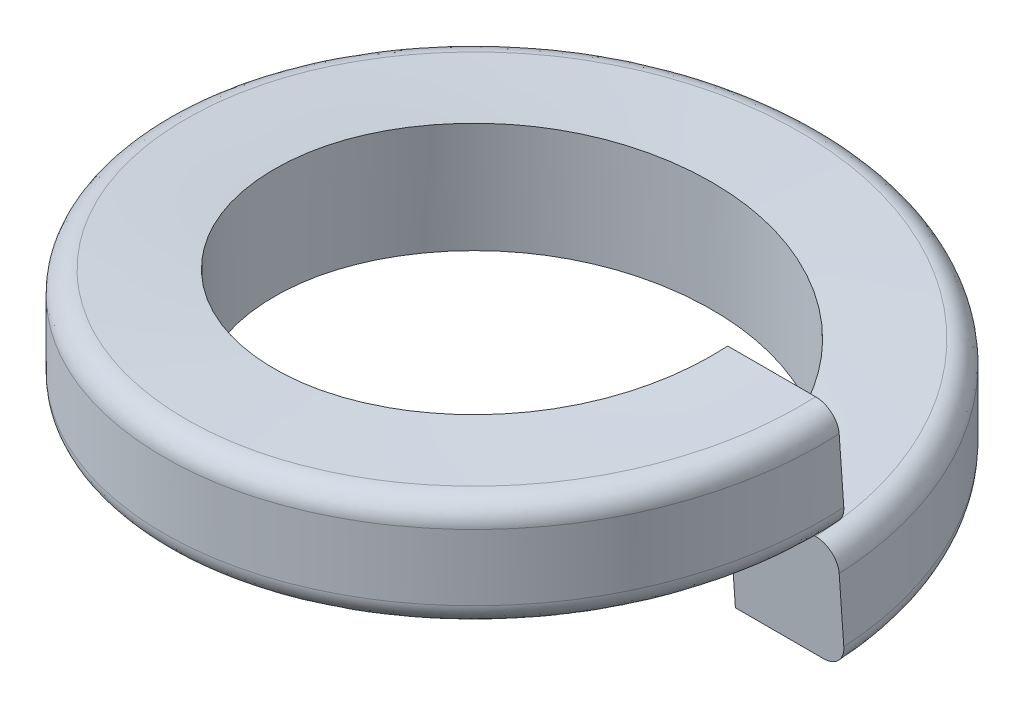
from build123d import *

# Parameters (mm, degrees)
SWEEP_3_PITCH       = 1.1
SWEEP_3_HEIGHT      = 1.1
SWEEP_3_RADIUS      = 2.5
SWEEP_3_START_ANGLE = 90
SKETCH_2_W          = 1
SKETCH_2_H          = 1
FILLET_1_R          = 0.2


with BuildPart() as part:
    # Sweep 3: sweep along a helix
    with BuildLine() as sweep_3_path:
        add(Helix(SWEEP_3_PITCH, SWEEP_3_HEIGHT, SWEEP_3_RADIUS, center=(0, 0, 0), direction=(0, -1, 0), mode=Mode.PRIVATE).rotate(Axis((0, 0, 0), (0, -1, 0)), SWEEP_3_START_ANGLE))
    # Sketch 2 → Sweep 3 (sweep)
    with BuildSketch(Plane(origin=(2.5, -1.1, 0), x_dir=(1, 0, 0), z_dir=(-1.0643875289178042e-14, -0.0698570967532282, 0.9975570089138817))):
        with Locations((-0.002374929, 0.005678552)):
            Rectangle(SKETCH_2_W, SKETCH_2_H)
    sweep(path=sweep_3_path.line, is_frenet=True)

    # Fillet 1
    fillet_1_edges = [part.edges().sort_by_distance(p)[0] for p in [
        (-2.997621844, -0.045556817, -0.035325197),
        (-2.997621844, -1.043113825, 0.034531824),
    ]]
    fillet(fillet_1_edges, radius=FILLET_1_R)


solid = part.part
